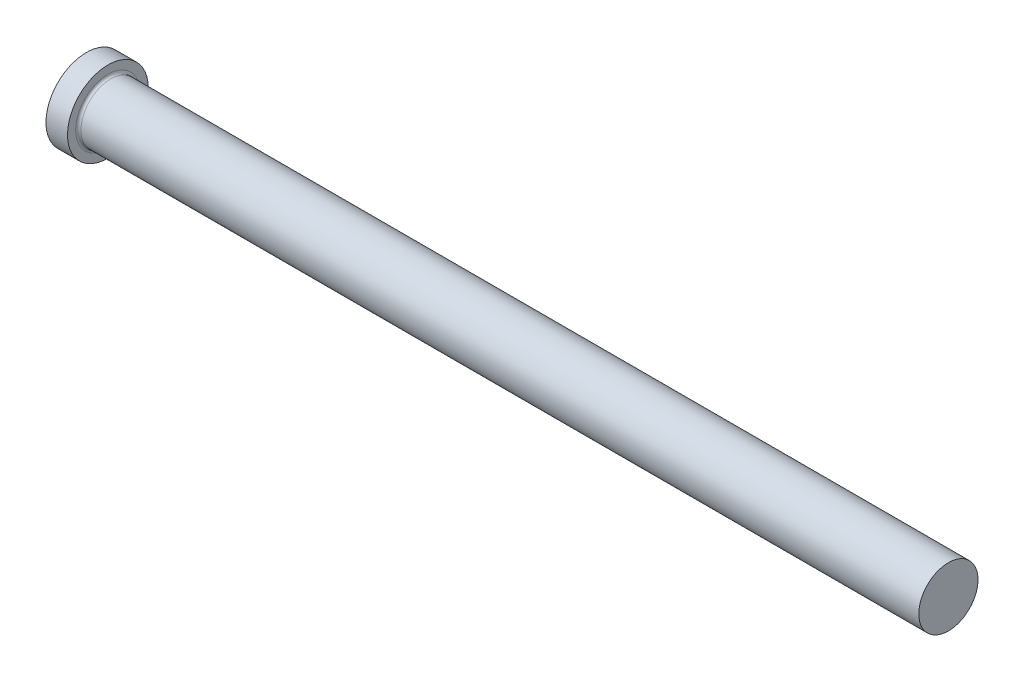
from build123d import *


with BuildPart() as part:
    # Sketch1 → PIN (revolve)
    with BuildSketch(Plane.XY, mode=Mode.PRIVATE) as pin_sk:
        with BuildLine():
            Line((0, 0), (0, 11.90625))
            Line((0, 11.90625), (6.35, 11.90625))
            Line((6.35, 11.90625), (6.35, 9.5123))
            ThreePointArc((6.35, 9.5123), (6.58062412, 8.95552412), (7.1374, 8.7249))
            Line((7.1374, 8.7249), (254, 8.7249))
            Line((254, 8.7249), (254, 0))
            Line((254, 0), (0, 0))
        make_face()
    revolve(pin_sk.sketch.rotate(Axis((254, 0, 0), (-1, 0, 0)), 180), axis=Axis((254, 0, 0), (-1, 0, 0)))


solid = part.part
